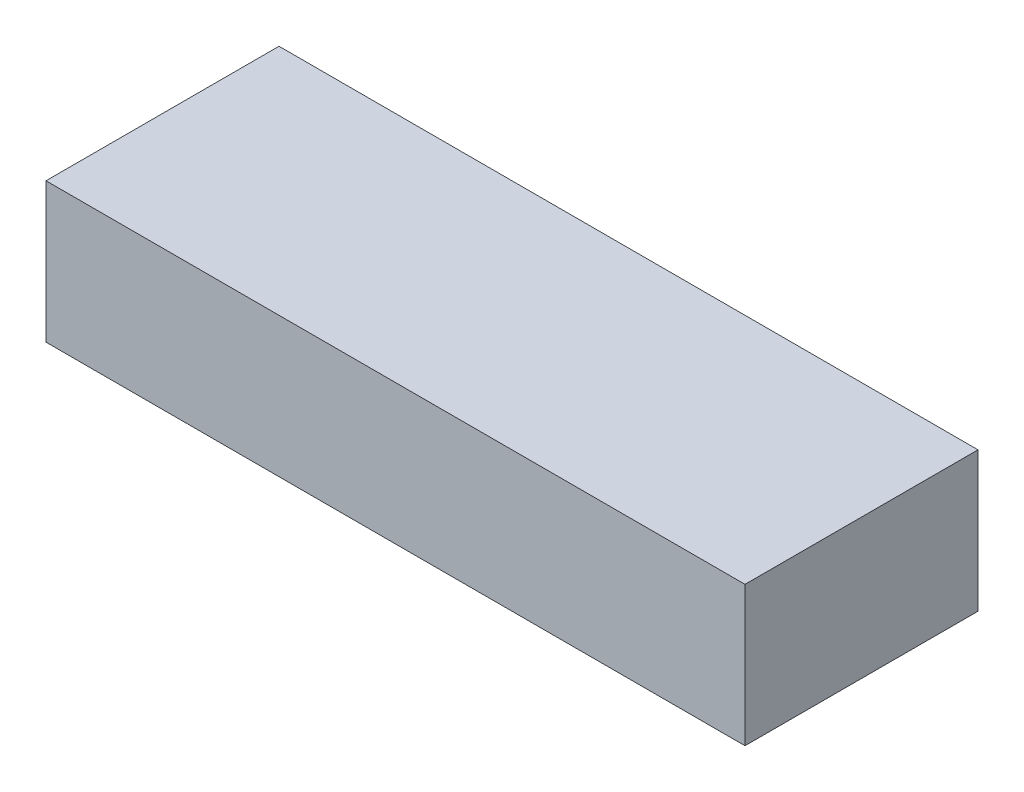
from build123d import *

# Parameters (mm, degrees)
ESQUISSE2_W      = 300
ESQUISSE2_H      = 100
EXTRUSION1_DEPTH = 60


with BuildPart() as part:
    # Esquisse2 → Extrusion1 (new body)
    with BuildSketch(Plane(origin=(0, 0, 0), x_dir=(1, 0, 0), z_dir=(0, 1, 0))):
        with Locations((150, 50)):
            Rectangle(ESQUISSE2_W, ESQUISSE2_H)
    extrude(amount=EXTRUSION1_DEPTH)


solid = part.part
